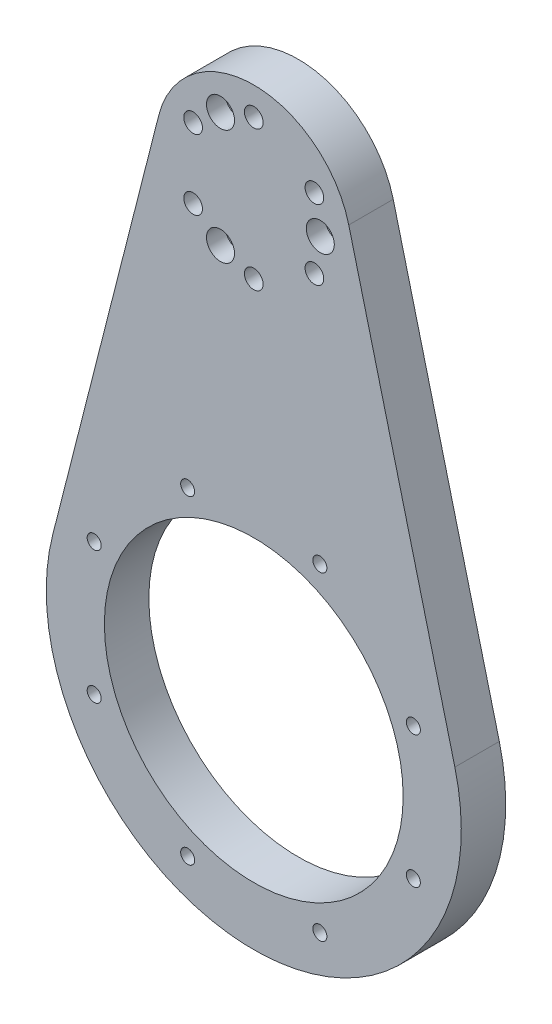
from build123d import *

# Parameters (mm, degrees)
SKETCH1_R           = 32
SKETCH1_R_2         = 1.5
SKETCH1_R_3         = 2
SKETCH1_R_4         = 3
BOSS_EXTRUDE1_DEPTH = 9.525
BOSS_EXTRUDE2_START = -9.525
SKETCH2_R           = 3
BOSS_EXTRUDE2_DEPTH = 5.525


with BuildPart() as part:
    # Sketch1 → Boss-Extrude1 (new body)
    with BuildSketch(Plane(origin=(0, 0, 0), x_dir=(0, 1, 0), z_dir=(0, 0, 1))):
        with BuildLine():
            Line((-84.027868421, 43.074526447), (5.183684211, 20.350169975))
            ThreePointArc((5.183684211, 20.350169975), (21, 0), (5.183684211, -20.350169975))
            Line((5.183684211, -20.350169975), (-84.027868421, -43.074526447))
            ThreePointArc((-84.027868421, -43.074526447), (-139.45, 0), (-84.027868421, 43.074526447))
        make_face()
        with Locations(Location((-95, 0, 0), (0, 0, 90))):
            Circle(SKETCH1_R, mode=Mode.SUBTRACT)
        with Locations(Location((-129.183542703, 14.159286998, 0), (0, 0, 90))):
            Circle(SKETCH1_R_2, mode=Mode.SUBTRACT)
        with Locations(Location((-109.159286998, 34.183542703, 0), (0, 0, 90))):
            Circle(SKETCH1_R_2, mode=Mode.SUBTRACT)
        with Locations(Location((-80.840713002, 34.183542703, 0), (0, 0, 90))):
            Circle(SKETCH1_R_2, mode=Mode.SUBTRACT)
        with Locations(Location((-60.816457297, 14.159286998, 0), (0, 0, 90))):
            Circle(SKETCH1_R_2, mode=Mode.SUBTRACT)
        with Locations(Location((-60.816457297, -14.159286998, 0), (0, 0, 90))):
            Circle(SKETCH1_R_2, mode=Mode.SUBTRACT)
        with Locations(Location((-80.840713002, -34.183542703, 0), (0, 0, 90))):
            Circle(SKETCH1_R_2, mode=Mode.SUBTRACT)
        with Locations(Location((-109.159286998, -34.183542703, 0), (0, 0, 90))):
            Circle(SKETCH1_R_2, mode=Mode.SUBTRACT)
        with Locations(Location((-129.183542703, -14.159286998, 0), (0, 0, 90))):
            Circle(SKETCH1_R_2, mode=Mode.SUBTRACT)
        with Locations(Location((15, 0, 0), (0, 0, 90))):
            Circle(SKETCH1_R_3, mode=Mode.SUBTRACT)
        with Locations(Location((7.5, -12.990381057, 0), (0, 0, 90))):
            Circle(SKETCH1_R_3, mode=Mode.SUBTRACT)
        with Locations(Location((-7.5, -12.990381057, 0), (0, 0, 90))):
            Circle(SKETCH1_R_3, mode=Mode.SUBTRACT)
        with Locations(Location((-15, 0, 0), (0, 0, 90))):
            Circle(SKETCH1_R_3, mode=Mode.SUBTRACT)
        with Locations(Location((-7.5, 12.990381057, 0), (0, 0, 90))):
            Circle(SKETCH1_R_3, mode=Mode.SUBTRACT)
        with Locations(Location((7.5, 12.990381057, 0), (0, 0, 90))):
            Circle(SKETCH1_R_3, mode=Mode.SUBTRACT)
        with Locations(Location((12.340862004, 7.125, 0), (0, 0, 90))):
            Circle(SKETCH1_R_4, mode=Mode.SUBTRACT)
        with Locations(Location((0, -14.25, 0), (0, 0, 90))):
            Circle(SKETCH1_R_4, mode=Mode.SUBTRACT)
        with Locations(Location((-12.340862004, 7.125, 0), (0, 0, 90))):
            Circle(SKETCH1_R_4, mode=Mode.SUBTRACT)
    extrude(amount=BOSS_EXTRUDE1_DEPTH)

    # Sketch2 → Boss-Extrude2 (add)
    with BuildSketch(Plane.XY.offset(9.525).offset(BOSS_EXTRUDE2_START)):
        with Locations(Location((-7.125, -12.340862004, 0), (0, 0, 180))):
            Circle(SKETCH2_R)
        with Locations(Location((14.25, 0, 0), (0, 0, 180))):
            Circle(SKETCH2_R)
        with Locations(Location((-7.125, 12.340862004, 0), (0, 0, 180))):
            Circle(SKETCH2_R)
    extrude(amount=BOSS_EXTRUDE2_DEPTH)


solid = part.part
